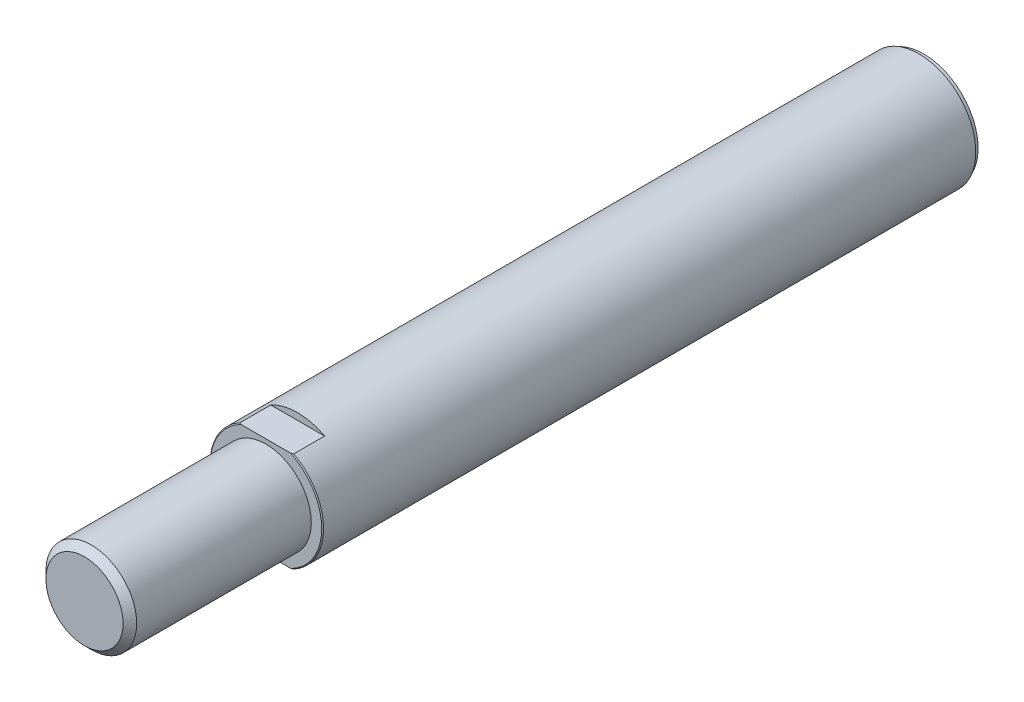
from build123d import *

# Parameters (mm, degrees)
ESBO_O1_R                       = 12.5
RESSALTO_EXTRUS_O1_DEPTH        = 185
ESBO_O2_OUTSIDE_W               = 64.67
ESBO_O2_OUTSIDE_H               = 64.67
ESBO_O2_OUTSIDE_R               = 10
CORTE_EXTRUS_O1_DEPTH           = 40
CHANFRO1_SIZE                   = 0.2
ESBO_O3_OUTSIDE_W               = 64.67
ESBO_O3_OUTSIDE_H               = 64.67
ESBO_O3_OUTSIDE_W_2             = 37.9352264
ESBO_O3_OUTSIDE_H_2             = 22
CORTE_EXTRUS_O2_DEPTH           = 7
CHANFRO2_SIZE                   = 1.5
ESBO_O4_OUTSIDE_W               = 64.67
ESBO_O4_OUTSIDE_H               = 64.67
ESBO_O4_OUTSIDE_R               = 12
CORTE_EXTRUS_O3_DEPTH           = 1
FURO_ROSCADO_DE_M12X1_751_D     = 10.2
FURO_ROSCADO_DE_M12X1_751_DEPTH = 32.75
FURO_ROSCADO_DE_M12X1_751_TIP   = 3.064389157


with BuildPart() as part:
    # Esbo_o1 → Ressalto-extrus_o1 (new body)
    with BuildSketch(Plane.XY):
        Circle(ESBO_O1_R)
    extrude(amount=RESSALTO_EXTRUS_O1_DEPTH)

    # Esbo_o2 outside → Corte-extrus_o1 (cut)
    with BuildSketch(Plane.XY.offset(185)):
        Rectangle(ESBO_O2_OUTSIDE_W, ESBO_O2_OUTSIDE_H)
        Circle(ESBO_O2_OUTSIDE_R, mode=Mode.SUBTRACT)
    extrude(amount=-CORTE_EXTRUS_O1_DEPTH, mode=Mode.SUBTRACT)

    # Chanfro1
    chanfro1_edges = [part.edges().sort_by_distance(p)[0] for p in [
        (-12.5, 0, 145),
    ]]
    chamfer(chanfro1_edges, length=CHANFRO1_SIZE)

    # Esbo_o3 outside → Corte-extrus_o2 (cut)
    with BuildSketch(Plane.XY.offset(145)):
        Rectangle(ESBO_O3_OUTSIDE_W, ESBO_O3_OUTSIDE_H)
        Rectangle(ESBO_O3_OUTSIDE_W_2, ESBO_O3_OUTSIDE_H_2, mode=Mode.SUBTRACT)
    extrude(amount=-CORTE_EXTRUS_O2_DEPTH, mode=Mode.SUBTRACT)

    # Chanfro2
    chanfro2_edges = [part.edges().sort_by_distance(p)[0] for p in [
        (-10, 0, 185),
    ]]
    chamfer(chanfro2_edges, length=CHANFRO2_SIZE)

    # Esbo_o4 outside → Corte-extrus_o3 (cut)
    with BuildSketch(Plane(origin=(0, 0, 0), x_dir=(-1, 0, 0), z_dir=(0, 0, -1))):
        Rectangle(ESBO_O4_OUTSIDE_W, ESBO_O4_OUTSIDE_H)
        Circle(ESBO_O4_OUTSIDE_R, mode=Mode.SUBTRACT)
    extrude(amount=-CORTE_EXTRUS_O3_DEPTH, mode=Mode.SUBTRACT)

    # Furo roscado de M12x1.751
    with Locations(Plane(origin=(0, 0, 0), x_dir=(-1, 0, 0), z_dir=(0, 0, -1))):
        with Locations((0, 0)):
            Hole(FURO_ROSCADO_DE_M12X1_751_D / 2, depth=FURO_ROSCADO_DE_M12X1_751_DEPTH)
            with Locations((0, 0, -(FURO_ROSCADO_DE_M12X1_751_DEPTH + FURO_ROSCADO_DE_M12X1_751_TIP / 2))):  # 118° drill point
                Cone(0, FURO_ROSCADO_DE_M12X1_751_D / 2, FURO_ROSCADO_DE_M12X1_751_TIP, mode=Mode.SUBTRACT)


solid = part.part
